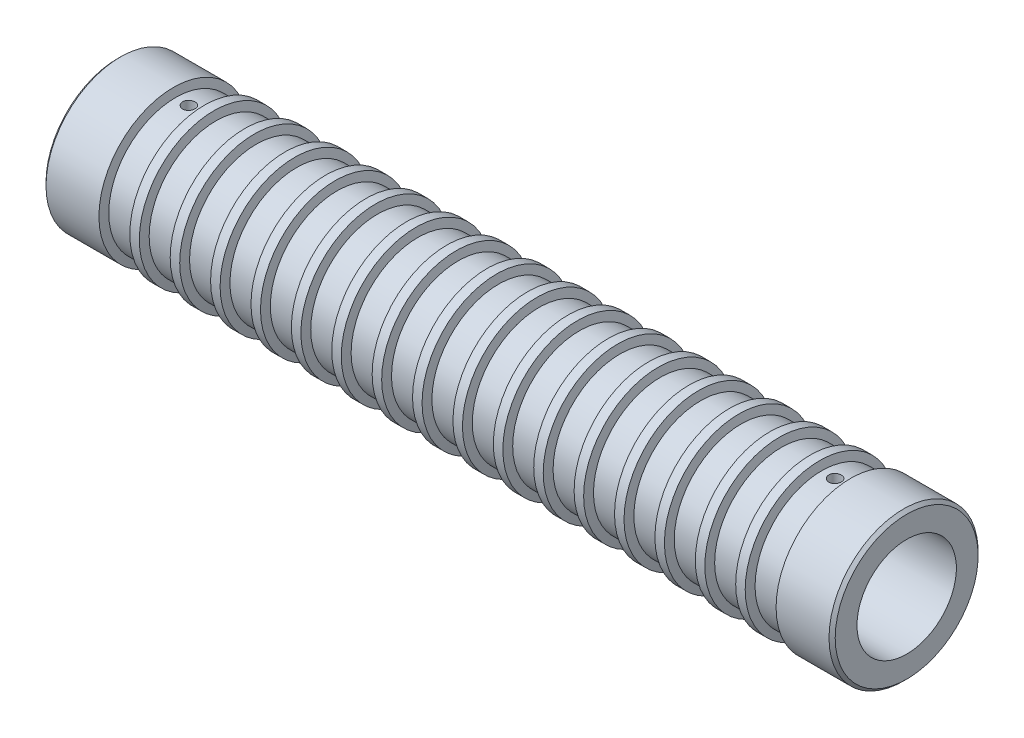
from build123d import *

# Parameters (mm, degrees)
F_2_0_2_DURCHMESSER_BOHRUNG2_REACH  = 111.101
F_2_0_2_DURCHMESSER_BOHRUNG2_BORE_R = 1


with BuildPart() as part:
    # Skizze1 → Basis-Rotation (revolve)
    with BuildSketch(Plane.XY, mode=Mode.PRIVATE) as basis_rotation_sk:
        Polygon((-63, 12), (-63.5, 11.5), (-63.5, 8), (-47.5, 8), (-47.5, 7.5), (47.5, 7.5), (47.5, 8), (63.5, 8), (63.5, 11.5), (63, 12), (54.484936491, 12), (54.15, 10.75), (49.85, 10.75), (49.515063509, 12), (47.984936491, 12), (47.65, 10.75), (43.35, 10.75), (43.015063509, 12), (41.484936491, 12), (41.15, 10.75), (36.85, 10.75), (36.515063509, 12), (34.984936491, 12), (34.65, 10.75), (30.35, 10.75), (30.015063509, 12), (28.484936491, 12), (28.15, 10.75), (23.85, 10.75), (23.515063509, 12), (21.984936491, 12), (21.65, 10.75), (17.35, 10.75), (17.015063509, 12), (15.484936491, 12), (15.15, 10.75), (10.85, 10.75), (10.515063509, 12), (8.984936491, 12), (8.65, 10.75), (4.35, 10.75), (4.015063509, 12), (2.484936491, 12), (2.15, 10.75), (-2.15, 10.75), (-2.484936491, 12), (-4.015063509, 12), (-4.35, 10.75), (-8.65, 10.75), (-8.984936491, 12), (-10.515063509, 12), (-10.85, 10.75), (-15.15, 10.75), (-15.484936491, 12), (-17.015063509, 12), (-17.35, 10.75), (-21.65, 10.75), (-21.984936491, 12), (-23.515063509, 12), (-23.85, 10.75), (-28.15, 10.75), (-28.484936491, 12), (-30.015063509, 12), (-30.35, 10.75), (-34.65, 10.75), (-34.984936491, 12), (-36.515063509, 12), (-36.85, 10.75), (-41.15, 10.75), (-41.484936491, 12), (-43.015063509, 12), (-43.35, 10.75), (-47.65, 10.75), (-47.984936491, 12), (-49.515063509, 12), (-49.85, 10.75), (-54.15, 10.75), (-54.484936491, 12), align=None)
    revolve(basis_rotation_sk.sketch.rotate(Axis((-63.5, 0, 0), (1, 0, 0)), 90), axis=Axis((-63.5, 0, 0), (1, 0, 0)))

    # 2.0 _2_ Durchmesser Bohrung2 bore → 2.0 _2_ Durchmesser Bohrung2 (cut, up to next)
    with BuildSketch(Plane(origin=(-42.25, 12, 0), x_dir=(0, 0, -1), z_dir=(0, 1, 0)), mode=Mode.PRIVATE) as f_2_0_2_durchmesser_bohrung2_sk1:
        with Locations((0, -94.25)):
            Circle(F_2_0_2_DURCHMESSER_BOHRUNG2_BORE_R)
    f_2_0_2_durchmesser_bohrung2_tool1 = extrude(f_2_0_2_durchmesser_bohrung2_sk1.sketch, amount=-F_2_0_2_DURCHMESSER_BOHRUNG2_REACH, mode=Mode.PRIVATE) & part.part
    # 2.0 _2_ Durchmesser Bohrung2 bore → 2.0 _2_ Durchmesser Bohrung2 (cut, up to next)
    with BuildSketch(Plane(origin=(-42.25, 12, 0), x_dir=(0, 0, -1), z_dir=(0, 1, 0)), mode=Mode.PRIVATE) as f_2_0_2_durchmesser_bohrung2_sk2:
        with Locations((0, 9.75)):
            Circle(F_2_0_2_DURCHMESSER_BOHRUNG2_BORE_R)
    f_2_0_2_durchmesser_bohrung2_tool2 = extrude(f_2_0_2_durchmesser_bohrung2_sk2.sketch, amount=-F_2_0_2_DURCHMESSER_BOHRUNG2_REACH, mode=Mode.PRIVATE) & part.part
    add(f_2_0_2_durchmesser_bohrung2_tool1.solids().sort_by_distance((52, 12, 0))[0], mode=Mode.SUBTRACT)
    add(f_2_0_2_durchmesser_bohrung2_tool2.solids().sort_by_distance((-52, 12, 0))[0], mode=Mode.SUBTRACT)


solid = part.part
